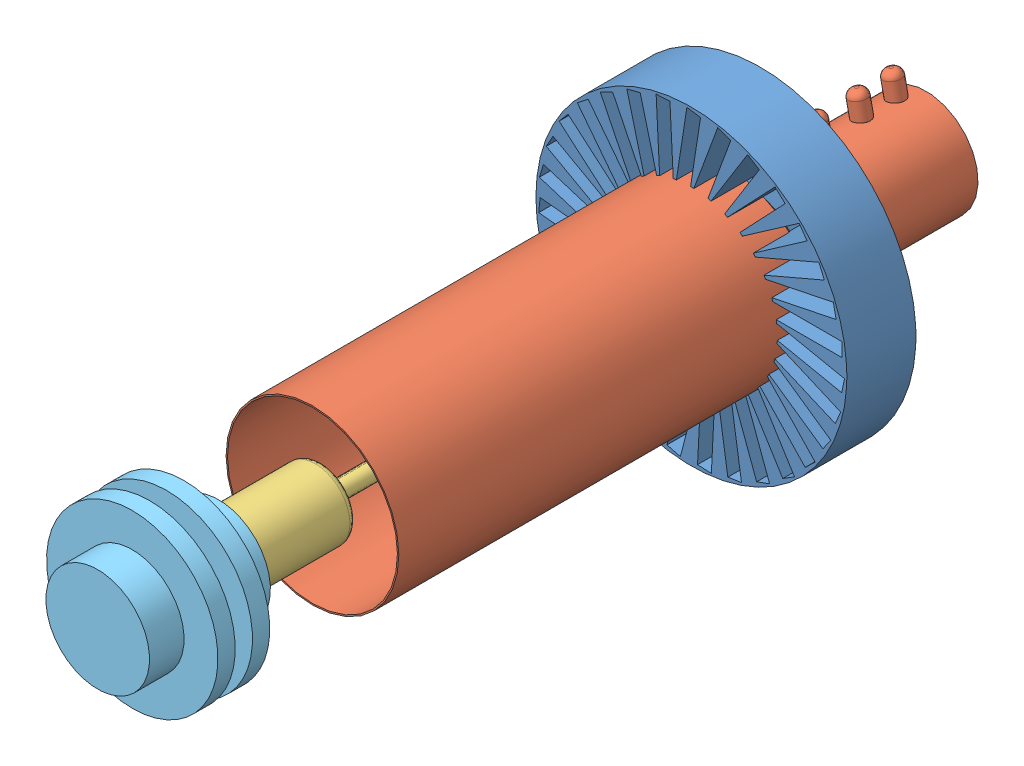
SolidWorks assembly Assembly.SLDASM, configuration Default (file format 10000). Lengths in mm.
Overall size (114.3 114.3 313.39).
5 component instances, 5 part files, 9 mates.
Components (placement in the parent):
- Fin-1: Fin.SLDPRT [Default] at (-96.8989 28.7166 18.9226) size (114.3 114.3 25.4)
- MainCylind-1: MainCylind.SLDPRT [Default] at (-96.8989 28.7166 -44.9914) x (0.979202 0.202887 0) z (0 0 1) size (63.5 63.5 234.44)
- Piston-1: Piston.SLDPRT [Default] at (-96.8989 28.7166 180.003) x (0.995846 -0.091058 0) z (0 0 1) size (25.4 25.4 139.7)
- Displacer-1: Displacer.SLDPRT [Default] at (-96.8989 28.7166 78.403) x (-0.888802 0.458291 0) z (0 0 1) size (25.4 25.4 50.8)
- Linear motor-1: Linear motor.SLDPRT [Default] at (-115.9006 27.3606 249.853) x (0 0 -1) z (-0.071181 0.997463 0) size (80.01 62.99 62.99)
Mates (geometry in assembly coordinates):
- Concentric6: concentric anti-aligned: cylinder of Piston-1 through (-96.8989 28.7166 78.403) axis (0 0 1) radius 3.1115; cylinder of Displacer-1 through (-96.8989 28.7166 129.203) axis (0 0 -1) radius 3.175
- Concentric8: concentric anti-aligned: cylinder of Piston-1 through (-96.8989 28.7166 218.103) axis (0 0 -1) radius 6.35; cylinder of Linear motor-1 through (-96.8989 28.7166 182.543) axis (0 0 1) radius 6.35
- Coincident1: coincident anti-aligned: plane of Piston-1 through (-96.8989 28.7166 218.103) normal (0 0 1); plane of Linear motor-1 through (-115.9006 27.3606 218.103) normal (0 0 -1)
- Concentric21: concentric anti-aligned: circle of Piston-1; circle of Displacer-1
- Concentric22: concentric anti-aligned: circle of Piston-1; circle of Displacer-1
- Coincident6: coincident aligned: circle of Piston-1; plane of Displacer-1 through (-96.8989 28.7166 78.403) normal (0 0 -1)
- Concentric29: concentric aligned: cylinder of MainCylind-1 through (-96.8989 28.7166 183.6086) axis (0 0 -1) radius 31.75; cylinder of Linear motor-1 through (-96.8989 28.7166 218.103) axis (0 0 -1) radius 19.05
- Coincident7: coincident: circle of Fin-1; cone of MainCylind-1 through (-96.8989 28.7166 31.2086) axis (0 0 -1)
- LimitDistance1: limit distance = 47.1944 mm anti-aligned: plane of Linear motor-1 through (-128.3151 26.4747 230.803) normal (0 0 -1); plane of MainCylind-1 through (-96.8989 28.7166 183.6086) normal (0 0 1)
